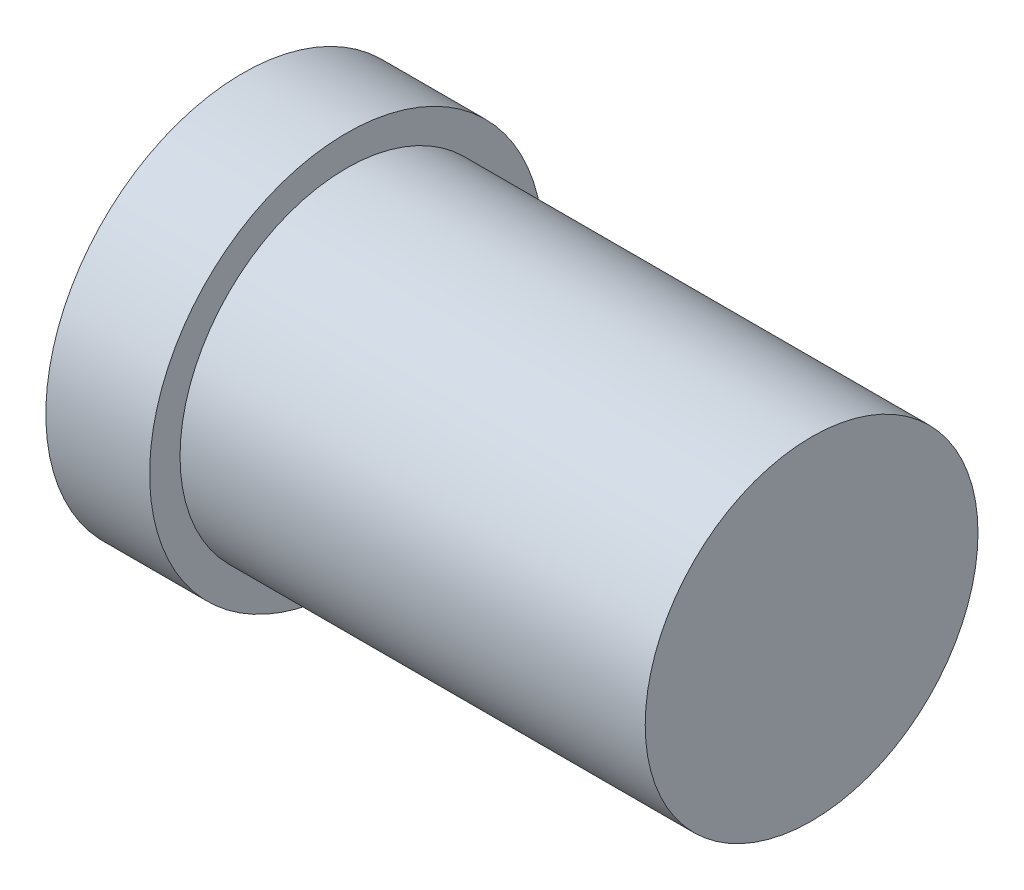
from build123d import *

# Parameters (mm, degrees)
SKETCH1_R          = 6.985
EXTRUDE1_DEPTH     = 3.683
SKETCH2_R          = 5.9055
EXTRUDE2_DEPTH     = 16.51
SKETCH3_R          = 5.9055
CUT_EXTRUDE1_DEPTH = 1.2446
CUT_EXTRUDE1_DRAFT = -53.6


with BuildPart() as part:
    # Sketch1 → Extrude1 (new body)
    with BuildSketch(Plane(origin=(0, 0, 0), x_dir=(0, 0, -1), z_dir=(1, 0, 0))):
        Circle(SKETCH1_R)
    extrude(amount=-EXTRUDE1_DEPTH)

    # Sketch2 → Extrude2 (add)
    with BuildSketch(Plane(origin=(0, 0, 0), x_dir=(0, 0, -1), z_dir=(1, 0, 0))):
        Circle(SKETCH2_R)
    extrude(amount=EXTRUDE2_DEPTH)


with BuildPart() as cut_extrude1_tool:
    # Sketch3 → Cut-Extrude1 (with draft: the straight prism first)
    with BuildSketch(Plane.ZY.offset(3.683)):
        with Locations(Location((0, 0, 0), (0, 0, 180))):
            Circle(SKETCH3_R)
    extrude(amount=-CUT_EXTRUDE1_DEPTH)
    # Cut-Extrude1: the draft: its side faces are tilted about the plane it starts from
    cut_extrude1_sides = [cut_extrude1_tool.faces().sort_by_distance(p)[0] for p in [
        (-3.0607, 0, 5.9055),
    ]]
    draft(cut_extrude1_sides, Plane.ZY.offset(3.683), CUT_EXTRUDE1_DRAFT)


with BuildPart() as part_1:
    add(part.part)

    # Cut-Extrude1: cut by cut_extrude1_tool
    add(cut_extrude1_tool.part, mode=Mode.SUBTRACT)

    # Sketch5 → Revolve1 (revolve)
    with BuildSketch(Plane.XY, mode=Mode.PRIVATE) as revolve1_sk:
        with BuildLine():
            Line((-2.4384, 0), (-2.4384, 4.217365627))
            ThreePointArc((-2.4384, 4.217365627), (-3.365355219, 2.198590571), (-3.683, 0))
            Line((-3.683, 0), (-2.4384, 0))
        make_face()
    revolve(revolve1_sk.sketch.rotate(Axis((-2.4384, 0, 0), (-1, 0, 0)), 270), axis=Axis((-2.4384, 0, 0), (-1, 0, 0)))


solid = part_1.part
